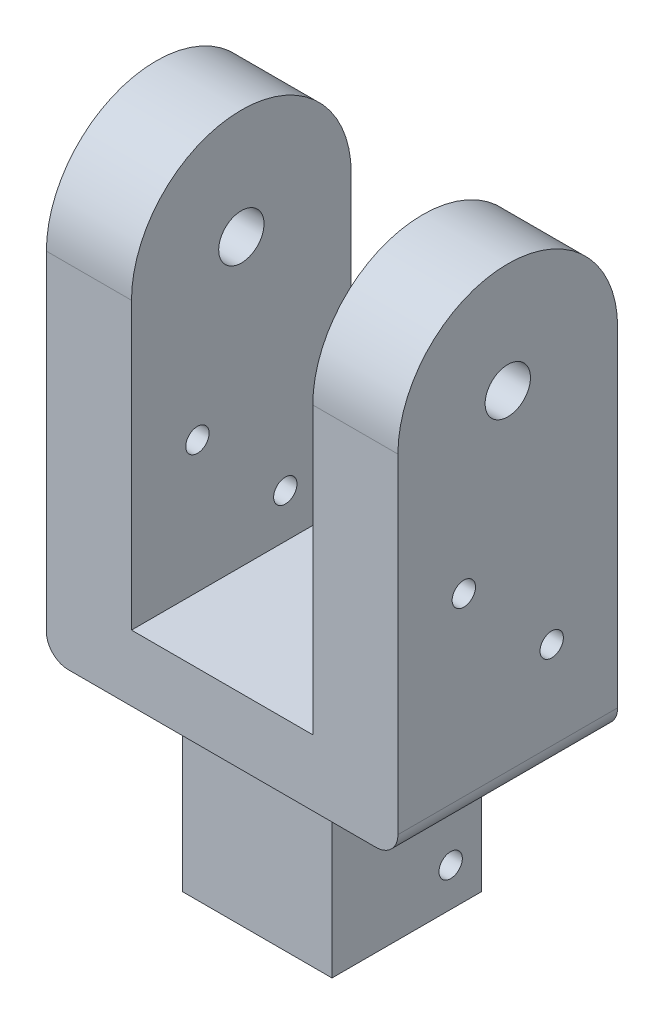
from build123d import *

# Parameters (mm, degrees)
SKETCH1_R          = 6.54812
EXTRUDE1_DEPTH     = 101.6
SKETCH2_W          = 127.290282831
SKETCH2_H          = 91.70538421
SKETCH2_W_2        = 43.18
SKETCH2_H_2        = 43.18
CUT_EXTRUDE1_DEPTH = 50.8
SKETCH3_W          = 52.3875
SKETCH3_H          = 118.241683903
CUT_EXTRUDE2_DEPTH = 194.857086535
SKETCH5_R          = 3.37312
CUT_EXTRUDE3_DEPTH = 172.68032677
FILLET1_R          = 6.35
CHAMFER1_SIZE      = 1.5875
SKETCH6_R          = 3.37312
CUT_EXTRUDE4_DEPTH = 186.893470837


with BuildPart() as part:
    # Sketch1 → Extrude1 (new body)
    with BuildSketch(Plane(origin=(0, 0, 0), x_dir=(0, 0, -1), z_dir=(1, 0, 0))):
        with BuildLine():
            Line((31.75, 0), (31.75, -152.4))
            Line((31.75, -152.4), (-31.75, -152.4))
            Line((-31.75, -152.4), (-31.75, 0))
            ThreePointArc((-31.75, 0), (0, 31.75), (31.75, 0))
        make_face()
        Circle(SKETCH1_R, mode=Mode.SUBTRACT)
    extrude(amount=EXTRUDE1_DEPTH)

    # Sketch2 → Cut-Extrude1 (cut)
    with BuildSketch(Plane.XZ.offset(152.4)):
        with Locations((47.054436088, 2.762017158)):
            Rectangle(SKETCH2_W, SKETCH2_H)
        with Locations((50.8, 0)):
            Rectangle(SKETCH2_W_2, SKETCH2_H_2, mode=Mode.SUBTRACT)
    extrude(amount=-CUT_EXTRUDE1_DEPTH, mode=Mode.SUBTRACT)

    # Sketch3 → Cut-Extrude2 (cut, through all)
    with BuildSketch(Plane.XY.offset(31.75)):
        with Locations((50.8, -23.429158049)):
            Rectangle(SKETCH3_W, SKETCH3_H)
    extrude(amount=-CUT_EXTRUDE2_DEPTH, mode=Mode.SUBTRACT)

    # Sketch5 → Cut-Extrude3 (cut, through all)
    with BuildSketch(Plane.ZY.offset(-29.21)):
        with Locations((12.7, -114.3)):
            Circle(SKETCH5_R)
        with Locations((-12.7, -139.7)):
            Circle(SKETCH5_R)
    extrude(amount=-CUT_EXTRUDE3_DEPTH, mode=Mode.SUBTRACT)

    # Fillet1
    fillet1_edges = [part.edges().sort_by_distance(p)[0] for p in [
        (101.6, -101.6, 0),
        (0, -101.6, 0),
    ]]
    fillet(fillet1_edges, radius=FILLET1_R)

    # Chamfer1
    chamfer1_edges = [part.edges().sort_by_distance(p)[0] for p in [
        (29.21, -152.4, 0),
        (50.8, -152.4, 21.59),
        (72.39, -152.4, 0),
        (50.8, -152.4, -21.59),
    ]]
    chamfer(chamfer1_edges, length=CHAMFER1_SIZE)

    # Sketch6 → Cut-Extrude4 (cut, through all)
    with BuildSketch(Plane.ZY):
        with Locations((12.7, -44.45)):
            Circle(SKETCH6_R)
        with Locations((-12.7, -69.85)):
            Circle(SKETCH6_R)
    extrude(amount=-CUT_EXTRUDE4_DEPTH, mode=Mode.SUBTRACT)


solid = part.part
